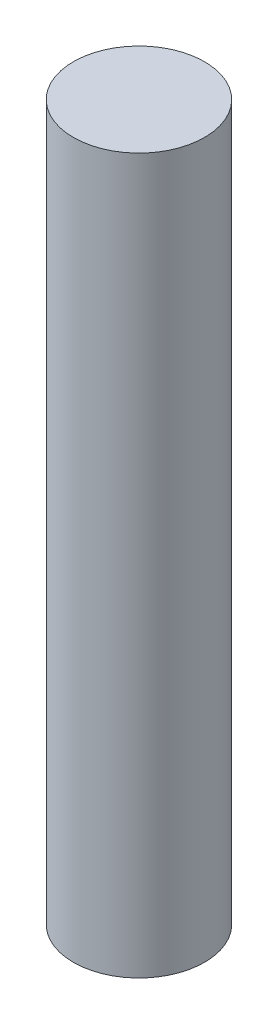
ISO-10303-21;
HEADER;
FILE_DESCRIPTION(('STEP AP214'),'2;1');
FILE_NAME('part.step','',(''),(''),'','','');
FILE_SCHEMA(('AUTOMOTIVE_DESIGN { 1 0 10303 214 1 1 1 1 }'));
ENDSEC;
DATA;
#1=APPLICATION_CONTEXT('core data for automotive mechanical design processes');
#2=APPLICATION_PROTOCOL_DEFINITION('international standard','automotive_design',2000,#1);
#3=PRODUCT_CONTEXT('',#1,'mechanical');
#4=PRODUCT('Part','Part','',(#3));
#5=PRODUCT_RELATED_PRODUCT_CATEGORY('part','',(#4));
#6=PRODUCT_DEFINITION_FORMATION('','',#4);
#7=PRODUCT_DEFINITION_CONTEXT('part definition',#1,'design');
#8=PRODUCT_DEFINITION('design','',#6,#7);
#9=PRODUCT_DEFINITION_SHAPE('','',#8);
#10=(LENGTH_UNIT() NAMED_UNIT(*) SI_UNIT(.MILLI.,.METRE.));
#11=(NAMED_UNIT(*) PLANE_ANGLE_UNIT() SI_UNIT($,.RADIAN.));
#12=(NAMED_UNIT(*) SI_UNIT($,.STERADIAN.) SOLID_ANGLE_UNIT());
#13=UNCERTAINTY_MEASURE_WITH_UNIT(LENGTH_MEASURE(1.E-05),#10,'distance_accuracy_value','');
#14=(GEOMETRIC_REPRESENTATION_CONTEXT(3) GLOBAL_UNCERTAINTY_ASSIGNED_CONTEXT((#13)) GLOBAL_UNIT_ASSIGNED_CONTEXT((#10,
#11,#12)) REPRESENTATION_CONTEXT('',''));
#15=CARTESIAN_POINT('',(0.,0.,0.));
#16=DIRECTION('',(0.,0.,1.));
#17=DIRECTION('',(1.,0.,0.));
#18=AXIS2_PLACEMENT_3D('',#15,#16,#17);
#19=CARTESIAN_POINT('',(0.,24.5,0.));
#20=DIRECTION('',(0.,-1.,0.));
#21=DIRECTION('',(0.,0.,-1.));
#22=AXIS2_PLACEMENT_3D('',#19,#20,#21);
#23=CYLINDRICAL_SURFACE('',#22,2.25);
#24=CARTESIAN_POINT('',(0.,24.5,0.));
#25=DIRECTION('',(0.,1.,0.));
#26=DIRECTION('',(0.,0.,1.));
#27=AXIS2_PLACEMENT_3D('',#24,#25,#26);
#28=CIRCLE('',#27,2.25);
#29=CARTESIAN_POINT('',(0.,24.5,2.25));
#30=VERTEX_POINT('',#29);
#31=EDGE_CURVE('E10',#30,#30,#28,.T.);
#32=ORIENTED_EDGE('',*,*,#31,.F.);
#33=EDGE_LOOP('',(#32));
#34=FACE_BOUND('',#33,.T.);
#35=CARTESIAN_POINT('',(0.,0.,0.));
#36=DIRECTION('',(0.,1.,0.));
#37=DIRECTION('',(0.,0.,1.));
#38=AXIS2_PLACEMENT_3D('',#35,#36,#37);
#39=CIRCLE('',#38,2.25);
#40=CARTESIAN_POINT('',(0.,0.,2.25));
#41=VERTEX_POINT('',#40);
#42=EDGE_CURVE('E48',#41,#41,#39,.T.);
#43=ORIENTED_EDGE('',*,*,#42,.T.);
#44=EDGE_LOOP('',(#43));
#45=FACE_BOUND('',#44,.T.);
#46=ADVANCED_FACE('F45',(#34,#45),#23,.T.);
#47=CARTESIAN_POINT('',(0.,24.5,0.));
#48=DIRECTION('',(0.,1.,0.));
#49=DIRECTION('',(0.,0.,1.));
#50=AXIS2_PLACEMENT_3D('',#47,#48,#49);
#51=PLANE('',#50);
#52=ORIENTED_EDGE('',*,*,#31,.T.);
#53=EDGE_LOOP('',(#52));
#54=FACE_BOUND('',#53,.T.);
#55=ADVANCED_FACE('F62',(#54),#51,.T.);
#56=CARTESIAN_POINT('',(0.,0.,0.));
#57=DIRECTION('',(0.,1.,0.));
#58=DIRECTION('',(0.,0.,1.));
#59=AXIS2_PLACEMENT_3D('',#56,#57,#58);
#60=PLANE('',#59);
#61=ORIENTED_EDGE('',*,*,#42,.F.);
#62=EDGE_LOOP('',(#61));
#63=FACE_BOUND('',#62,.T.);
#64=ADVANCED_FACE('F60',(#63),#60,.F.);
#65=CLOSED_SHELL('',(#46,#55,#64));
#66=MANIFOLD_SOLID_BREP('B2',#65);
#67=ADVANCED_BREP_SHAPE_REPRESENTATION('',(#18,#66),#14);
#68=SHAPE_DEFINITION_REPRESENTATION(#9,#67);
ENDSEC;
END-ISO-10303-21;
